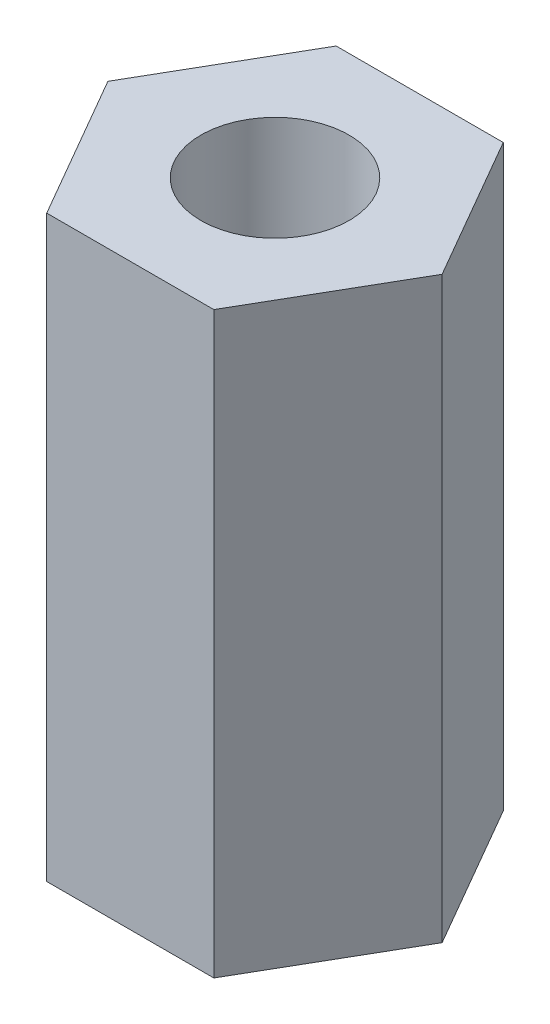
ISO-10303-21;
HEADER;
FILE_DESCRIPTION(('STEP AP214'),'2;1');
FILE_NAME('part.step','',(''),(''),'','','');
FILE_SCHEMA(('AUTOMOTIVE_DESIGN { 1 0 10303 214 1 1 1 1 }'));
ENDSEC;
DATA;
#1=APPLICATION_CONTEXT('core data for automotive mechanical design processes');
#2=APPLICATION_PROTOCOL_DEFINITION('international standard','automotive_design',2000,#1);
#3=PRODUCT_CONTEXT('',#1,'mechanical');
#4=PRODUCT('Part','Part','',(#3));
#5=PRODUCT_RELATED_PRODUCT_CATEGORY('part','',(#4));
#6=PRODUCT_DEFINITION_FORMATION('','',#4);
#7=PRODUCT_DEFINITION_CONTEXT('part definition',#1,'design');
#8=PRODUCT_DEFINITION('design','',#6,#7);
#9=PRODUCT_DEFINITION_SHAPE('','',#8);
#10=(LENGTH_UNIT() NAMED_UNIT(*) SI_UNIT(.MILLI.,.METRE.));
#11=(NAMED_UNIT(*) PLANE_ANGLE_UNIT() SI_UNIT($,.RADIAN.));
#12=(NAMED_UNIT(*) SI_UNIT($,.STERADIAN.) SOLID_ANGLE_UNIT());
#13=UNCERTAINTY_MEASURE_WITH_UNIT(LENGTH_MEASURE(1.E-05),#10,'distance_accuracy_value','');
#14=(GEOMETRIC_REPRESENTATION_CONTEXT(3) GLOBAL_UNCERTAINTY_ASSIGNED_CONTEXT((#13)) GLOBAL_UNIT_ASSIGNED_CONTEXT((#10,
#11,#12)) REPRESENTATION_CONTEXT('',''));
#15=CARTESIAN_POINT('',(0.,0.,0.));
#16=DIRECTION('',(0.,0.,1.));
#17=DIRECTION('',(1.,0.,0.));
#18=AXIS2_PLACEMENT_3D('',#15,#16,#17);
#19=CARTESIAN_POINT('',(0.,12.7,0.));
#20=DIRECTION('',(0.,1.,0.));
#21=DIRECTION('',(0.,0.,1.));
#22=AXIS2_PLACEMENT_3D('',#19,#20,#21);
#23=PLANE('',#22);
#24=DIRECTION('',(-0.500000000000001,0.,-0.866025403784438));
#25=VECTOR('',#24,1.);
#26=CARTESIAN_POINT('',(3.66617420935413,12.7,0.));
#27=LINE('',#26,#25);
#28=CARTESIAN_POINT('',(3.66617420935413,12.7,0.));
#29=VERTEX_POINT('',#28);
#30=CARTESIAN_POINT('',(1.83308710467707,12.7,-3.175));
#31=VERTEX_POINT('',#30);
#32=EDGE_CURVE('E129',#29,#31,#27,.T.);
#33=ORIENTED_EDGE('',*,*,#32,.T.);
#34=DIRECTION('',(-1.,0.,0.));
#35=VECTOR('',#34,1.);
#36=CARTESIAN_POINT('',(1.83308710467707,12.7,-3.175));
#37=LINE('',#36,#35);
#38=CARTESIAN_POINT('',(-1.83308710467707,12.7,-3.175));
#39=VERTEX_POINT('',#38);
#40=EDGE_CURVE('E87',#31,#39,#37,.T.);
#41=ORIENTED_EDGE('',*,*,#40,.T.);
#42=DIRECTION('',(-0.500000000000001,0.,0.866025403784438));
#43=VECTOR('',#42,1.);
#44=CARTESIAN_POINT('',(-1.83308710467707,12.7,-3.175));
#45=LINE('',#44,#43);
#46=CARTESIAN_POINT('',(-3.66617420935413,12.7,0.));
#47=VERTEX_POINT('',#46);
#48=EDGE_CURVE('E100',#39,#47,#45,.T.);
#49=ORIENTED_EDGE('',*,*,#48,.T.);
#50=DIRECTION('',(0.5,0.,0.866025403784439));
#51=VECTOR('',#50,1.);
#52=CARTESIAN_POINT('',(-3.66617420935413,12.7,0.));
#53=LINE('',#52,#51);
#54=CARTESIAN_POINT('',(-1.83308710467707,12.7,3.175));
#55=VERTEX_POINT('',#54);
#56=EDGE_CURVE('E94',#47,#55,#53,.T.);
#57=ORIENTED_EDGE('',*,*,#56,.T.);
#58=DIRECTION('',(1.,0.,0.));
#59=VECTOR('',#58,1.);
#60=CARTESIAN_POINT('',(-1.83308710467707,12.7,3.175));
#61=LINE('',#60,#59);
#62=CARTESIAN_POINT('',(1.83308710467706,12.7,3.175));
#63=VERTEX_POINT('',#62);
#64=EDGE_CURVE('E98',#55,#63,#61,.T.);
#65=ORIENTED_EDGE('',*,*,#64,.T.);
#66=DIRECTION('',(0.500000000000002,0.,-0.866025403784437));
#67=VECTOR('',#66,1.);
#68=CARTESIAN_POINT('',(1.83308710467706,12.7,3.175));
#69=LINE('',#68,#67);
#70=EDGE_CURVE('E50',#63,#29,#69,.T.);
#71=ORIENTED_EDGE('',*,*,#70,.T.);
#72=EDGE_LOOP('',(#33,#41,#49,#57,#65,#71));
#73=FACE_BOUND('',#72,.T.);
#74=CARTESIAN_POINT('',(0.,12.7,0.));
#75=DIRECTION('',(0.,1.,0.));
#76=DIRECTION('',(0.,0.,1.));
#77=AXIS2_PLACEMENT_3D('',#74,#75,#76);
#78=CIRCLE('',#77,1.6256);
#79=CARTESIAN_POINT('',(0.,12.7,1.6256));
#80=VERTEX_POINT('',#79);
#81=EDGE_CURVE('E122',#80,#80,#78,.T.);
#82=ORIENTED_EDGE('',*,*,#81,.F.);
#83=EDGE_LOOP('',(#82));
#84=FACE_BOUND('',#83,.T.);
#85=ADVANCED_FACE('F33',(#73,#84),#23,.T.);
#86=CARTESIAN_POINT('',(0.,0.,0.));
#87=DIRECTION('',(0.,1.,0.));
#88=DIRECTION('',(0.,0.,1.));
#89=AXIS2_PLACEMENT_3D('',#86,#87,#88);
#90=PLANE('',#89);
#91=DIRECTION('',(-0.500000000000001,0.,-0.866025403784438));
#92=VECTOR('',#91,1.);
#93=CARTESIAN_POINT('',(3.66617420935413,0.,0.));
#94=LINE('',#93,#92);
#95=CARTESIAN_POINT('',(3.66617420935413,0.,0.));
#96=VERTEX_POINT('',#95);
#97=CARTESIAN_POINT('',(1.83308710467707,0.,-3.175));
#98=VERTEX_POINT('',#97);
#99=EDGE_CURVE('E118',#96,#98,#94,.T.);
#100=ORIENTED_EDGE('',*,*,#99,.F.);
#101=DIRECTION('',(0.500000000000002,0.,-0.866025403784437));
#102=VECTOR('',#101,1.);
#103=CARTESIAN_POINT('',(1.83308710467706,0.,3.175));
#104=LINE('',#103,#102);
#105=CARTESIAN_POINT('',(1.83308710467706,0.,3.175));
#106=VERTEX_POINT('',#105);
#107=EDGE_CURVE('E79',#106,#96,#104,.T.);
#108=ORIENTED_EDGE('',*,*,#107,.F.);
#109=DIRECTION('',(1.,0.,0.));
#110=VECTOR('',#109,1.);
#111=CARTESIAN_POINT('',(-1.83308710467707,0.,3.175));
#112=LINE('',#111,#110);
#113=CARTESIAN_POINT('',(-1.83308710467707,0.,3.175));
#114=VERTEX_POINT('',#113);
#115=EDGE_CURVE('E73',#114,#106,#112,.T.);
#116=ORIENTED_EDGE('',*,*,#115,.F.);
#117=DIRECTION('',(0.5,0.,0.866025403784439));
#118=VECTOR('',#117,1.);
#119=CARTESIAN_POINT('',(-3.66617420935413,0.,0.));
#120=LINE('',#119,#118);
#121=CARTESIAN_POINT('',(-3.66617420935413,0.,0.));
#122=VERTEX_POINT('',#121);
#123=EDGE_CURVE('E108',#122,#114,#120,.T.);
#124=ORIENTED_EDGE('',*,*,#123,.F.);
#125=DIRECTION('',(-0.500000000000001,0.,0.866025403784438));
#126=VECTOR('',#125,1.);
#127=CARTESIAN_POINT('',(-1.83308710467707,0.,-3.175));
#128=LINE('',#127,#126);
#129=CARTESIAN_POINT('',(-1.83308710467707,0.,-3.175));
#130=VERTEX_POINT('',#129);
#131=EDGE_CURVE('E124',#130,#122,#128,.T.);
#132=ORIENTED_EDGE('',*,*,#131,.F.);
#133=DIRECTION('',(-1.,0.,0.));
#134=VECTOR('',#133,1.);
#135=CARTESIAN_POINT('',(1.83308710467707,0.,-3.175));
#136=LINE('',#135,#134);
#137=EDGE_CURVE('E121',#98,#130,#136,.T.);
#138=ORIENTED_EDGE('',*,*,#137,.F.);
#139=EDGE_LOOP('',(#100,#108,#116,#124,#132,#138));
#140=FACE_BOUND('',#139,.T.);
#141=CARTESIAN_POINT('',(0.,0.,0.));
#142=DIRECTION('',(0.,1.,0.));
#143=DIRECTION('',(0.,0.,1.));
#144=AXIS2_PLACEMENT_3D('',#141,#142,#143);
#145=CIRCLE('',#144,1.6256);
#146=CARTESIAN_POINT('',(0.,0.,1.6256));
#147=VERTEX_POINT('',#146);
#148=EDGE_CURVE('E222',#147,#147,#145,.T.);
#149=ORIENTED_EDGE('',*,*,#148,.T.);
#150=EDGE_LOOP('',(#149));
#151=FACE_BOUND('',#150,.T.);
#152=ADVANCED_FACE('F138',(#140,#151),#90,.F.);
#153=CARTESIAN_POINT('',(3.66617420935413,12.7,0.));
#154=DIRECTION('',(-0.866025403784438,0.,0.500000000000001));
#155=DIRECTION('',(0.500000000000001,0.,0.866025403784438));
#156=AXIS2_PLACEMENT_3D('',#153,#154,#155);
#157=PLANE('',#156);
#158=ORIENTED_EDGE('',*,*,#99,.T.);
#159=DIRECTION('',(0.,-1.,0.));
#160=VECTOR('',#159,1.);
#161=CARTESIAN_POINT('',(1.83308710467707,12.7,-3.175));
#162=LINE('',#161,#160);
#163=EDGE_CURVE('E11',#31,#98,#162,.T.);
#164=ORIENTED_EDGE('',*,*,#163,.F.);
#165=ORIENTED_EDGE('',*,*,#32,.F.);
#166=DIRECTION('',(0.,-1.,0.));
#167=VECTOR('',#166,1.);
#168=CARTESIAN_POINT('',(3.66617420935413,12.7,0.));
#169=LINE('',#168,#167);
#170=EDGE_CURVE('E114',#29,#96,#169,.T.);
#171=ORIENTED_EDGE('',*,*,#170,.T.);
#172=EDGE_LOOP('',(#158,#164,#165,#171));
#173=FACE_BOUND('',#172,.T.);
#174=ADVANCED_FACE('F35',(#173),#157,.F.);
#175=CARTESIAN_POINT('',(1.83308710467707,12.7,-3.175));
#176=DIRECTION('',(0.,0.,1.));
#177=DIRECTION('',(1.,0.,0.));
#178=AXIS2_PLACEMENT_3D('',#175,#176,#177);
#179=PLANE('',#178);
#180=ORIENTED_EDGE('',*,*,#137,.T.);
#181=DIRECTION('',(0.,-1.,0.));
#182=VECTOR('',#181,1.);
#183=CARTESIAN_POINT('',(-1.83308710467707,12.7,-3.175));
#184=LINE('',#183,#182);
#185=EDGE_CURVE('E42',#39,#130,#184,.T.);
#186=ORIENTED_EDGE('',*,*,#185,.F.);
#187=ORIENTED_EDGE('',*,*,#40,.F.);
#188=ORIENTED_EDGE('',*,*,#163,.T.);
#189=EDGE_LOOP('',(#180,#186,#187,#188));
#190=FACE_BOUND('',#189,.T.);
#191=ADVANCED_FACE('F163',(#190),#179,.F.);
#192=CARTESIAN_POINT('',(-1.83308710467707,12.7,-3.175));
#193=DIRECTION('',(0.866025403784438,0.,0.500000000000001));
#194=DIRECTION('',(0.500000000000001,0.,-0.866025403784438));
#195=AXIS2_PLACEMENT_3D('',#192,#193,#194);
#196=PLANE('',#195);
#197=ORIENTED_EDGE('',*,*,#131,.T.);
#198=DIRECTION('',(0.,-1.,0.));
#199=VECTOR('',#198,1.);
#200=CARTESIAN_POINT('',(-3.66617420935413,12.7,0.));
#201=LINE('',#200,#199);
#202=EDGE_CURVE('E109',#47,#122,#201,.T.);
#203=ORIENTED_EDGE('',*,*,#202,.F.);
#204=ORIENTED_EDGE('',*,*,#48,.F.);
#205=ORIENTED_EDGE('',*,*,#185,.T.);
#206=EDGE_LOOP('',(#197,#203,#204,#205));
#207=FACE_BOUND('',#206,.T.);
#208=ADVANCED_FACE('F135',(#207),#196,.F.);
#209=CARTESIAN_POINT('',(-3.66617420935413,12.7,0.));
#210=DIRECTION('',(0.866025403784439,0.,-0.5));
#211=DIRECTION('',(-0.5,0.,-0.866025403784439));
#212=AXIS2_PLACEMENT_3D('',#209,#210,#211);
#213=PLANE('',#212);
#214=ORIENTED_EDGE('',*,*,#123,.T.);
#215=DIRECTION('',(0.,-1.,0.));
#216=VECTOR('',#215,1.);
#217=CARTESIAN_POINT('',(-1.83308710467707,12.7,3.175));
#218=LINE('',#217,#216);
#219=EDGE_CURVE('E105',#55,#114,#218,.T.);
#220=ORIENTED_EDGE('',*,*,#219,.F.);
#221=ORIENTED_EDGE('',*,*,#56,.F.);
#222=ORIENTED_EDGE('',*,*,#202,.T.);
#223=EDGE_LOOP('',(#214,#220,#221,#222));
#224=FACE_BOUND('',#223,.T.);
#225=ADVANCED_FACE('F106',(#224),#213,.F.);
#226=CARTESIAN_POINT('',(-1.83308710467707,12.7,3.175));
#227=DIRECTION('',(0.,0.,-1.));
#228=DIRECTION('',(-1.,0.,0.));
#229=AXIS2_PLACEMENT_3D('',#226,#227,#228);
#230=PLANE('',#229);
#231=ORIENTED_EDGE('',*,*,#115,.T.);
#232=DIRECTION('',(0.,-1.,0.));
#233=VECTOR('',#232,1.);
#234=CARTESIAN_POINT('',(1.83308710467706,12.7,3.175));
#235=LINE('',#234,#233);
#236=EDGE_CURVE('E110',#63,#106,#235,.T.);
#237=ORIENTED_EDGE('',*,*,#236,.F.);
#238=ORIENTED_EDGE('',*,*,#64,.F.);
#239=ORIENTED_EDGE('',*,*,#219,.T.);
#240=EDGE_LOOP('',(#231,#237,#238,#239));
#241=FACE_BOUND('',#240,.T.);
#242=ADVANCED_FACE('F112',(#241),#230,.F.);
#243=CARTESIAN_POINT('',(1.83308710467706,12.7,3.175));
#244=DIRECTION('',(-0.866025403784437,0.,-0.500000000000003));
#245=DIRECTION('',(-0.500000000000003,0.,0.866025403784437));
#246=AXIS2_PLACEMENT_3D('',#243,#244,#245);
#247=PLANE('',#246);
#248=ORIENTED_EDGE('',*,*,#107,.T.);
#249=ORIENTED_EDGE('',*,*,#170,.F.);
#250=ORIENTED_EDGE('',*,*,#70,.F.);
#251=ORIENTED_EDGE('',*,*,#236,.T.);
#252=EDGE_LOOP('',(#248,#249,#250,#251));
#253=FACE_BOUND('',#252,.T.);
#254=ADVANCED_FACE('F143',(#253),#247,.F.);
#255=CARTESIAN_POINT('',(0.,12.7,0.));
#256=DIRECTION('',(0.,-1.,0.));
#257=DIRECTION('',(0.,0.,-1.));
#258=AXIS2_PLACEMENT_3D('',#255,#256,#257);
#259=CYLINDRICAL_SURFACE('',#258,1.6256);
#260=ORIENTED_EDGE('',*,*,#81,.T.);
#261=EDGE_LOOP('',(#260));
#262=FACE_BOUND('',#261,.T.);
#263=ORIENTED_EDGE('',*,*,#148,.F.);
#264=EDGE_LOOP('',(#263));
#265=FACE_BOUND('',#264,.T.);
#266=ADVANCED_FACE('F145',(#262,#265),#259,.F.);
#267=CLOSED_SHELL('',(#85,#152,#174,#191,#208,#225,#242,#254,#266));
#268=MANIFOLD_SOLID_BREP('B2',#267);
#269=ADVANCED_BREP_SHAPE_REPRESENTATION('',(#18,#268),#14);
#270=SHAPE_DEFINITION_REPRESENTATION(#9,#269);
ENDSEC;
END-ISO-10303-21;
